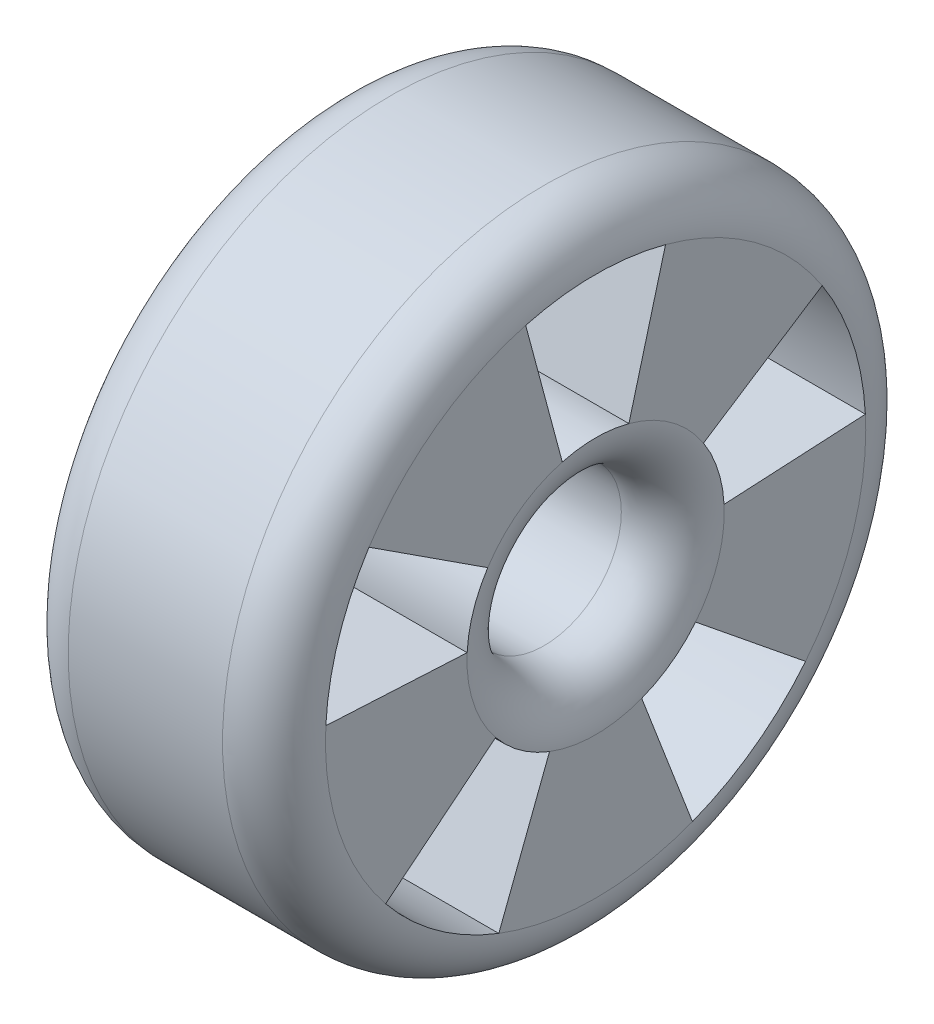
from build123d import *

# Parameters (mm, degrees)
SKETCH_1_R               = 12.5
SKETCH_1_R_2             = 3
EXTRUDE_1_DEPTH          = 10
FILLET_1_R               = 2
CUT_EXTRUDE_1_DEPTH      = 21.310096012
PATTERN_CIRCULAR_1_COUNT = 5


with BuildPart() as part:
    # Sketch 1 → Extrude 1 (new body)
    with BuildSketch(Plane(origin=(0, 0, 0), x_dir=(0, 0, -1), z_dir=(1, 0, 0))):
        Circle(SKETCH_1_R)
        Circle(SKETCH_1_R_2, mode=Mode.SUBTRACT)
    extrude(amount=EXTRUDE_1_DEPTH)

    # Fillet 1
    fillet_1_edges = [part.edges().sort_by_distance(p)[0] for p in [
        (0, 0, 12.5),
        (10, 0, 12.5),
        (0, 0, 3),
        (10, 0, 3),
    ]]
    fillet(fillet_1_edges, radius=FILLET_1_R)

    # Sketch 2 → Cut-Extrude 1 (cut, through all)
    with BuildSketch(Plane(origin=(10, 0, 0), x_dir=(0, 0, -1), z_dir=(1, 0, 0))):
        with BuildLine():
            Line((2.717599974, 10.142221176), (1.294095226, 4.829629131))
            ThreePointArc((1.294095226, 4.829629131), (0, 5), (-1.294095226, 4.829629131))
            Line((-1.294095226, 4.829629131), (-2.717599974, 10.142221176))
            ThreePointArc((-2.717599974, 10.142221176), (0, 10.5), (2.717599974, 10.142221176))
        make_face()
    cut_extrude_1 = extrude(amount=-CUT_EXTRUDE_1_DEPTH, mode=Mode.SUBTRACT)

    # Pattern Circular 1: Cut-Extrude 1 ×5 about axis
    pattern_circular_1_axis = Axis((0, 0, 0), (1, 0, 0))
    for i in range(1, PATTERN_CIRCULAR_1_COUNT):
        add(cut_extrude_1.rotate(pattern_circular_1_axis, i * 360 / PATTERN_CIRCULAR_1_COUNT), mode=Mode.SUBTRACT)


solid = part.part
